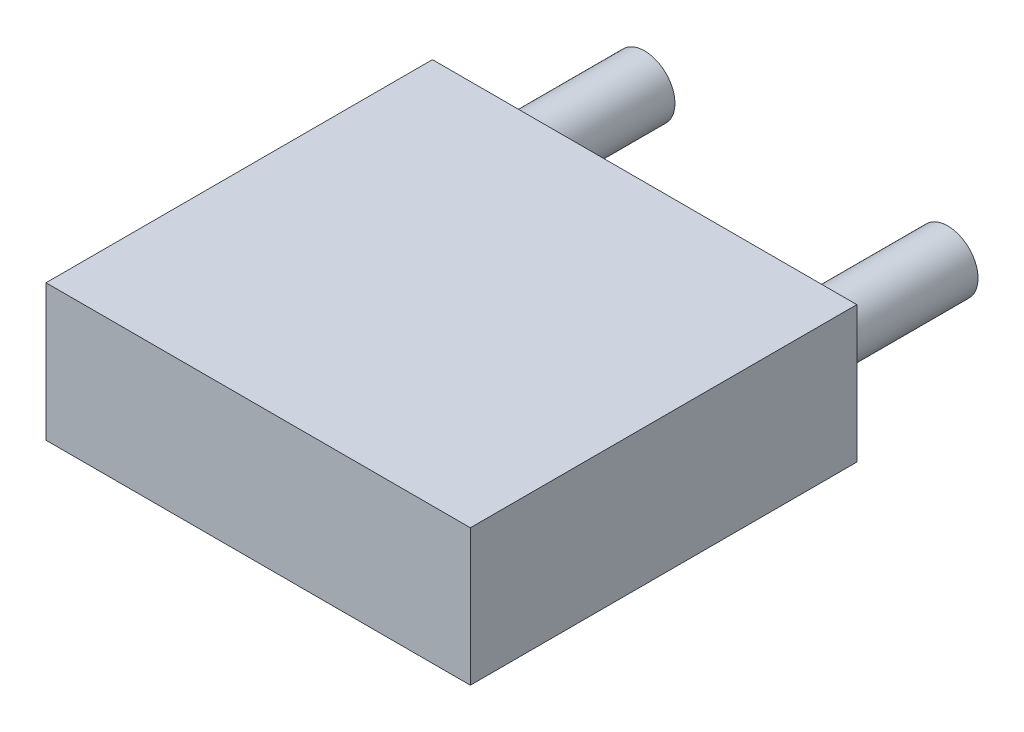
ISO-10303-21;
HEADER;
FILE_DESCRIPTION(('STEP AP214'),'2;1');
FILE_NAME('part.step','',(''),(''),'','','');
FILE_SCHEMA(('AUTOMOTIVE_DESIGN { 1 0 10303 214 1 1 1 1 }'));
ENDSEC;
DATA;
#1=APPLICATION_CONTEXT('core data for automotive mechanical design processes');
#2=APPLICATION_PROTOCOL_DEFINITION('international standard','automotive_design',2000,#1);
#3=PRODUCT_CONTEXT('',#1,'mechanical');
#4=PRODUCT('Part','Part','',(#3));
#5=PRODUCT_RELATED_PRODUCT_CATEGORY('part','',(#4));
#6=PRODUCT_DEFINITION_FORMATION('','',#4);
#7=PRODUCT_DEFINITION_CONTEXT('part definition',#1,'design');
#8=PRODUCT_DEFINITION('design','',#6,#7);
#9=PRODUCT_DEFINITION_SHAPE('','',#8);
#10=(LENGTH_UNIT() NAMED_UNIT(*) SI_UNIT(.MILLI.,.METRE.));
#11=(NAMED_UNIT(*) PLANE_ANGLE_UNIT() SI_UNIT($,.RADIAN.));
#12=(NAMED_UNIT(*) SI_UNIT($,.STERADIAN.) SOLID_ANGLE_UNIT());
#13=UNCERTAINTY_MEASURE_WITH_UNIT(LENGTH_MEASURE(1.E-05),#10,'distance_accuracy_value','');
#14=(GEOMETRIC_REPRESENTATION_CONTEXT(3) GLOBAL_UNCERTAINTY_ASSIGNED_CONTEXT((#13)) GLOBAL_UNIT_ASSIGNED_CONTEXT((#10,
#11,#12)) REPRESENTATION_CONTEXT('',''));
#15=CARTESIAN_POINT('',(0.,0.,0.));
#16=DIRECTION('',(0.,0.,1.));
#17=DIRECTION('',(1.,0.,0.));
#18=AXIS2_PLACEMENT_3D('',#15,#16,#17);
#19=CARTESIAN_POINT('',(2.54,0.,-2.54));
#20=DIRECTION('',(0.,0.,1.));
#21=DIRECTION('',(1.,0.,0.));
#22=AXIS2_PLACEMENT_3D('',#19,#20,#21);
#23=CYLINDRICAL_SURFACE('',#22,0.508);
#24=CARTESIAN_POINT('',(2.54,0.,-2.54));
#25=DIRECTION('',(0.,0.,-1.));
#26=DIRECTION('',(-1.,0.,0.));
#27=AXIS2_PLACEMENT_3D('',#24,#25,#26);
#28=CIRCLE('',#27,0.508);
#29=CARTESIAN_POINT('',(2.032,0.,-2.54));
#30=VERTEX_POINT('',#29);
#31=EDGE_CURVE('E11',#30,#30,#28,.T.);
#32=ORIENTED_EDGE('',*,*,#31,.F.);
#33=EDGE_LOOP('',(#32));
#34=FACE_BOUND('',#33,.T.);
#35=CARTESIAN_POINT('',(2.54,0.,0.));
#36=DIRECTION('',(0.,0.,-1.));
#37=DIRECTION('',(-1.,0.,0.));
#38=AXIS2_PLACEMENT_3D('',#35,#36,#37);
#39=CIRCLE('',#38,0.508);
#40=CARTESIAN_POINT('',(2.032,0.,0.));
#41=VERTEX_POINT('',#40);
#42=EDGE_CURVE('E40',#41,#41,#39,.T.);
#43=ORIENTED_EDGE('',*,*,#42,.T.);
#44=EDGE_LOOP('',(#43));
#45=FACE_BOUND('',#44,.T.);
#46=ADVANCED_FACE('F37',(#34,#45),#23,.T.);
#47=CARTESIAN_POINT('',(2.54,0.,-2.54));
#48=DIRECTION('',(0.,0.,-1.));
#49=DIRECTION('',(-1.,0.,0.));
#50=AXIS2_PLACEMENT_3D('',#47,#48,#49);
#51=PLANE('',#50);
#52=ORIENTED_EDGE('',*,*,#31,.T.);
#53=EDGE_LOOP('',(#52));
#54=FACE_BOUND('',#53,.T.);
#55=ADVANCED_FACE('F52',(#54),#51,.T.);
#56=CARTESIAN_POINT('',(2.54,0.,0.));
#57=DIRECTION('',(0.,0.,-1.));
#58=DIRECTION('',(-1.,0.,0.));
#59=AXIS2_PLACEMENT_3D('',#56,#57,#58);
#60=PLANE('',#59);
#61=ORIENTED_EDGE('',*,*,#42,.F.);
#62=EDGE_LOOP('',(#61));
#63=FACE_BOUND('',#62,.T.);
#64=ADVANCED_FACE('F50',(#63),#60,.F.);
#65=CLOSED_SHELL('',(#46,#55,#64));
#66=MANIFOLD_SOLID_BREP('B2',#65);
#67=CARTESIAN_POINT('',(-2.54,0.,-2.54));
#68=DIRECTION('',(0.,0.,1.));
#69=DIRECTION('',(1.,0.,0.));
#70=AXIS2_PLACEMENT_3D('',#67,#68,#69);
#71=CYLINDRICAL_SURFACE('',#70,0.508);
#72=CARTESIAN_POINT('',(-2.54,0.,-2.54));
#73=DIRECTION('',(0.,0.,-1.));
#74=DIRECTION('',(-1.,0.,0.));
#75=AXIS2_PLACEMENT_3D('',#72,#73,#74);
#76=CIRCLE('',#75,0.508);
#77=CARTESIAN_POINT('',(-3.048,0.,-2.54));
#78=VERTEX_POINT('',#77);
#79=EDGE_CURVE('E36',#78,#78,#76,.T.);
#80=ORIENTED_EDGE('',*,*,#79,.F.);
#81=EDGE_LOOP('',(#80));
#82=FACE_BOUND('',#81,.T.);
#83=CARTESIAN_POINT('',(-2.54,0.,0.));
#84=DIRECTION('',(0.,0.,-1.));
#85=DIRECTION('',(-1.,0.,0.));
#86=AXIS2_PLACEMENT_3D('',#83,#84,#85);
#87=CIRCLE('',#86,0.508);
#88=CARTESIAN_POINT('',(-3.048,0.,0.));
#89=VERTEX_POINT('',#88);
#90=EDGE_CURVE('E89',#89,#89,#87,.T.);
#91=ORIENTED_EDGE('',*,*,#90,.T.);
#92=EDGE_LOOP('',(#91));
#93=FACE_BOUND('',#92,.T.);
#94=ADVANCED_FACE('F86',(#82,#93),#71,.T.);
#95=CARTESIAN_POINT('',(-2.54,0.,-2.54));
#96=DIRECTION('',(0.,0.,-1.));
#97=DIRECTION('',(-1.,0.,0.));
#98=AXIS2_PLACEMENT_3D('',#95,#96,#97);
#99=PLANE('',#98);
#100=ORIENTED_EDGE('',*,*,#79,.T.);
#101=EDGE_LOOP('',(#100));
#102=FACE_BOUND('',#101,.T.);
#103=ADVANCED_FACE('F101',(#102),#99,.T.);
#104=CARTESIAN_POINT('',(-2.54,0.,0.));
#105=DIRECTION('',(0.,0.,-1.));
#106=DIRECTION('',(-1.,0.,0.));
#107=AXIS2_PLACEMENT_3D('',#104,#105,#106);
#108=PLANE('',#107);
#109=ORIENTED_EDGE('',*,*,#90,.F.);
#110=EDGE_LOOP('',(#109));
#111=FACE_BOUND('',#110,.T.);
#112=ADVANCED_FACE('F99',(#111),#108,.F.);
#113=CLOSED_SHELL('',(#94,#103,#112));
#114=MANIFOLD_SOLID_BREP('B6',#113);
#115=CARTESIAN_POINT('',(-3.556,1.143,6.477));
#116=DIRECTION('',(1.,0.,0.));
#117=DIRECTION('',(0.,0.,-1.));
#118=AXIS2_PLACEMENT_3D('',#115,#116,#117);
#119=PLANE('',#118);
#120=DIRECTION('',(0.,-1.,0.));
#121=VECTOR('',#120,1.);
#122=CARTESIAN_POINT('',(-3.556,1.143,0.));
#123=LINE('',#122,#121);
#124=CARTESIAN_POINT('',(-3.556,1.143,0.));
#125=VERTEX_POINT('',#124);
#126=CARTESIAN_POINT('',(-3.556,-1.143,0.));
#127=VERTEX_POINT('',#126);
#128=EDGE_CURVE('E189',#125,#127,#123,.T.);
#129=ORIENTED_EDGE('',*,*,#128,.T.);
#130=DIRECTION('',(0.,0.,-1.));
#131=VECTOR('',#130,1.);
#132=CARTESIAN_POINT('',(-3.556,-1.143,6.477));
#133=LINE('',#132,#131);
#134=CARTESIAN_POINT('',(-3.556,-1.143,6.477));
#135=VERTEX_POINT('',#134);
#136=EDGE_CURVE('E84',#135,#127,#133,.T.);
#137=ORIENTED_EDGE('',*,*,#136,.F.);
#138=DIRECTION('',(0.,-1.,0.));
#139=VECTOR('',#138,1.);
#140=CARTESIAN_POINT('',(-3.556,1.143,6.477));
#141=LINE('',#140,#139);
#142=CARTESIAN_POINT('',(-3.556,1.143,6.477));
#143=VERTEX_POINT('',#142);
#144=EDGE_CURVE('E177',#143,#135,#141,.T.);
#145=ORIENTED_EDGE('',*,*,#144,.F.);
#146=DIRECTION('',(0.,0.,-1.));
#147=VECTOR('',#146,1.);
#148=CARTESIAN_POINT('',(-3.556,1.143,6.477));
#149=LINE('',#148,#147);
#150=EDGE_CURVE('E185',#143,#125,#149,.T.);
#151=ORIENTED_EDGE('',*,*,#150,.T.);
#152=EDGE_LOOP('',(#129,#137,#145,#151));
#153=FACE_BOUND('',#152,.T.);
#154=ADVANCED_FACE('F126',(#153),#119,.F.);
#155=CARTESIAN_POINT('',(-3.556,-1.143,6.477));
#156=DIRECTION('',(0.,1.,0.));
#157=DIRECTION('',(0.,0.,1.));
#158=AXIS2_PLACEMENT_3D('',#155,#156,#157);
#159=PLANE('',#158);
#160=DIRECTION('',(1.,0.,0.));
#161=VECTOR('',#160,1.);
#162=CARTESIAN_POINT('',(-3.556,-1.143,0.));
#163=LINE('',#162,#161);
#164=CARTESIAN_POINT('',(3.556,-1.143,0.));
#165=VERTEX_POINT('',#164);
#166=EDGE_CURVE('E181',#127,#165,#163,.T.);
#167=ORIENTED_EDGE('',*,*,#166,.T.);
#168=DIRECTION('',(0.,0.,-1.));
#169=VECTOR('',#168,1.);
#170=CARTESIAN_POINT('',(3.556,-1.143,6.477));
#171=LINE('',#170,#169);
#172=CARTESIAN_POINT('',(3.556,-1.143,6.477));
#173=VERTEX_POINT('',#172);
#174=EDGE_CURVE('E134',#173,#165,#171,.T.);
#175=ORIENTED_EDGE('',*,*,#174,.F.);
#176=DIRECTION('',(1.,0.,0.));
#177=VECTOR('',#176,1.);
#178=CARTESIAN_POINT('',(-3.556,-1.143,6.477));
#179=LINE('',#178,#177);
#180=EDGE_CURVE('E172',#135,#173,#179,.T.);
#181=ORIENTED_EDGE('',*,*,#180,.F.);
#182=ORIENTED_EDGE('',*,*,#136,.T.);
#183=EDGE_LOOP('',(#167,#175,#181,#182));
#184=FACE_BOUND('',#183,.T.);
#185=ADVANCED_FACE('F180',(#184),#159,.F.);
#186=CARTESIAN_POINT('',(3.556,1.143,6.477));
#187=DIRECTION('',(-1.,0.,0.));
#188=DIRECTION('',(0.,0.,1.));
#189=AXIS2_PLACEMENT_3D('',#186,#187,#188);
#190=PLANE('',#189);
#191=DIRECTION('',(0.,1.,0.));
#192=VECTOR('',#191,1.);
#193=CARTESIAN_POINT('',(3.556,1.143,0.));
#194=LINE('',#193,#192);
#195=CARTESIAN_POINT('',(3.556,1.143,0.));
#196=VERTEX_POINT('',#195);
#197=EDGE_CURVE('E159',#165,#196,#194,.T.);
#198=ORIENTED_EDGE('',*,*,#197,.T.);
#199=DIRECTION('',(0.,0.,-1.));
#200=VECTOR('',#199,1.);
#201=CARTESIAN_POINT('',(3.556,1.143,6.477));
#202=LINE('',#201,#200);
#203=CARTESIAN_POINT('',(3.556,1.143,6.477));
#204=VERTEX_POINT('',#203);
#205=EDGE_CURVE('E182',#204,#196,#202,.T.);
#206=ORIENTED_EDGE('',*,*,#205,.F.);
#207=DIRECTION('',(0.,1.,0.));
#208=VECTOR('',#207,1.);
#209=CARTESIAN_POINT('',(3.556,1.143,6.477));
#210=LINE('',#209,#208);
#211=EDGE_CURVE('E175',#173,#204,#210,.T.);
#212=ORIENTED_EDGE('',*,*,#211,.F.);
#213=ORIENTED_EDGE('',*,*,#174,.T.);
#214=EDGE_LOOP('',(#198,#206,#212,#213));
#215=FACE_BOUND('',#214,.T.);
#216=ADVANCED_FACE('F183',(#215),#190,.F.);
#217=CARTESIAN_POINT('',(-3.556,1.143,6.477));
#218=DIRECTION('',(0.,-1.,0.));
#219=DIRECTION('',(0.,0.,-1.));
#220=AXIS2_PLACEMENT_3D('',#217,#218,#219);
#221=PLANE('',#220);
#222=DIRECTION('',(-1.,0.,0.));
#223=VECTOR('',#222,1.);
#224=CARTESIAN_POINT('',(-3.556,1.143,0.));
#225=LINE('',#224,#223);
#226=EDGE_CURVE('E165',#196,#125,#225,.T.);
#227=ORIENTED_EDGE('',*,*,#226,.T.);
#228=ORIENTED_EDGE('',*,*,#150,.F.);
#229=DIRECTION('',(-1.,0.,0.));
#230=VECTOR('',#229,1.);
#231=CARTESIAN_POINT('',(-3.556,1.143,6.477));
#232=LINE('',#231,#230);
#233=EDGE_CURVE('E142',#204,#143,#232,.T.);
#234=ORIENTED_EDGE('',*,*,#233,.F.);
#235=ORIENTED_EDGE('',*,*,#205,.T.);
#236=EDGE_LOOP('',(#227,#228,#234,#235));
#237=FACE_BOUND('',#236,.T.);
#238=ADVANCED_FACE('F196',(#237),#221,.F.);
#239=CARTESIAN_POINT('',(-3.556,-1.143,6.477));
#240=DIRECTION('',(0.,0.,1.));
#241=DIRECTION('',(1.,0.,0.));
#242=AXIS2_PLACEMENT_3D('',#239,#240,#241);
#243=PLANE('',#242);
#244=ORIENTED_EDGE('',*,*,#144,.T.);
#245=ORIENTED_EDGE('',*,*,#180,.T.);
#246=ORIENTED_EDGE('',*,*,#211,.T.);
#247=ORIENTED_EDGE('',*,*,#233,.T.);
#248=EDGE_LOOP('',(#244,#245,#246,#247));
#249=FACE_BOUND('',#248,.T.);
#250=ADVANCED_FACE('F173',(#249),#243,.T.);
#251=CARTESIAN_POINT('',(-3.556,-1.143,0.));
#252=DIRECTION('',(0.,0.,1.));
#253=DIRECTION('',(1.,0.,0.));
#254=AXIS2_PLACEMENT_3D('',#251,#252,#253);
#255=PLANE('',#254);
#256=ORIENTED_EDGE('',*,*,#128,.F.);
#257=ORIENTED_EDGE('',*,*,#226,.F.);
#258=ORIENTED_EDGE('',*,*,#197,.F.);
#259=ORIENTED_EDGE('',*,*,#166,.F.);
#260=EDGE_LOOP('',(#256,#257,#258,#259));
#261=FACE_BOUND('',#260,.T.);
#262=ADVANCED_FACE('F199',(#261),#255,.F.);
#263=CLOSED_SHELL('',(#154,#185,#216,#238,#250,#262));
#264=MANIFOLD_SOLID_BREP('B31',#263);
#265=ADVANCED_BREP_SHAPE_REPRESENTATION('',(#18,#66,#114,#264),#14);
#266=SHAPE_DEFINITION_REPRESENTATION(#9,#265);
ENDSEC;
END-ISO-10303-21;
